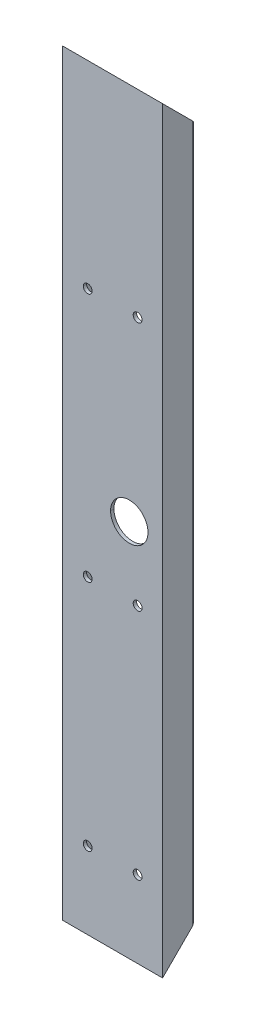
ISO-10303-21;
HEADER;
FILE_DESCRIPTION(('STEP AP214'),'2;1');
FILE_NAME('part.step','',(''),(''),'','','');
FILE_SCHEMA(('AUTOMOTIVE_DESIGN { 1 0 10303 214 1 1 1 1 }'));
ENDSEC;
DATA;
#1=APPLICATION_CONTEXT('core data for automotive mechanical design processes');
#2=APPLICATION_PROTOCOL_DEFINITION('international standard','automotive_design',2000,#1);
#3=PRODUCT_CONTEXT('',#1,'mechanical');
#4=PRODUCT('Part','Part','',(#3));
#5=PRODUCT_RELATED_PRODUCT_CATEGORY('part','',(#4));
#6=PRODUCT_DEFINITION_FORMATION('','',#4);
#7=PRODUCT_DEFINITION_CONTEXT('part definition',#1,'design');
#8=PRODUCT_DEFINITION('design','',#6,#7);
#9=PRODUCT_DEFINITION_SHAPE('','',#8);
#10=(LENGTH_UNIT() NAMED_UNIT(*) SI_UNIT(.MILLI.,.METRE.));
#11=(NAMED_UNIT(*) PLANE_ANGLE_UNIT() SI_UNIT($,.RADIAN.));
#12=(NAMED_UNIT(*) SI_UNIT($,.STERADIAN.) SOLID_ANGLE_UNIT());
#13=UNCERTAINTY_MEASURE_WITH_UNIT(LENGTH_MEASURE(1.E-05),#10,'distance_accuracy_value','');
#14=(GEOMETRIC_REPRESENTATION_CONTEXT(3) GLOBAL_UNCERTAINTY_ASSIGNED_CONTEXT((#13)) GLOBAL_UNIT_ASSIGNED_CONTEXT((#10,
#11,#12)) REPRESENTATION_CONTEXT('',''));
#15=CARTESIAN_POINT('',(0.,0.,0.));
#16=DIRECTION('',(0.,0.,1.));
#17=DIRECTION('',(1.,0.,0.));
#18=AXIS2_PLACEMENT_3D('',#15,#16,#17);
#19=CARTESIAN_POINT('',(-63.98972165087,577.85,13.9572396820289));
#20=DIRECTION('',(0.987440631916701,0.,-0.1579905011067));
#21=DIRECTION('',(-0.1579905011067,0.,-0.987440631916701));
#22=AXIS2_PLACEMENT_3D('',#19,#20,#21);
#23=PLANE('',#22);
#24=DIRECTION('',(0.112419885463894,0.702624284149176,0.702624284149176));
#25=VECTOR('',#24,1.);
#26=CARTESIAN_POINT('',(-69.5959999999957,532.384,-21.0819999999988));
#27=LINE('',#26,#25);
#28=CARTESIAN_POINT('',(-69.5959999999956,532.384,-21.0819999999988));
#29=VERTEX_POINT('',#28);
#30=CARTESIAN_POINT('',(-63.98972165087,567.423239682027,13.9572396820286));
#31=VERTEX_POINT('',#30);
#32=EDGE_CURVE('E396',#29,#31,#27,.T.);
#33=ORIENTED_EDGE('',*,*,#32,.T.);
#34=DIRECTION('',(0.,-1.,0.));
#35=VECTOR('',#34,1.);
#36=CARTESIAN_POINT('',(-63.9897216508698,577.85,13.9572396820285));
#37=LINE('',#36,#35);
#38=CARTESIAN_POINT('',(-63.989721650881,-567.423239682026,13.9572396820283));
#39=VERTEX_POINT('',#38);
#40=EDGE_CURVE('E258',#39,#31,#37,.F.);
#41=ORIENTED_EDGE('',*,*,#40,.F.);
#42=DIRECTION('',(-0.11241988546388,0.702624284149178,-0.702624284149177));
#43=VECTOR('',#42,1.);
#44=CARTESIAN_POINT('',(-63.9897216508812,-567.423239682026,13.9572396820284));
#45=LINE('',#44,#43);
#46=CARTESIAN_POINT('',(-69.5960000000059,-532.383999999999,-21.0819999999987));
#47=VERTEX_POINT('',#46);
#48=EDGE_CURVE('E266',#39,#47,#45,.T.);
#49=ORIENTED_EDGE('',*,*,#48,.T.);
#50=DIRECTION('',(0.,-1.,0.));
#51=VECTOR('',#50,1.);
#52=CARTESIAN_POINT('',(-69.5959999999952,577.85,-21.0819999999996));
#53=LINE('',#52,#51);
#54=EDGE_CURVE('E263',#29,#47,#53,.T.);
#55=ORIENTED_EDGE('',*,*,#54,.F.);
#56=EDGE_LOOP('',(#33,#41,#49,#55));
#57=FACE_BOUND('',#56,.T.);
#58=CARTESIAN_POINT('',(-66.3854399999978,273.050000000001,-1.01599999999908));
#59=DIRECTION('',(0.987440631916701,0.,-0.1579905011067));
#60=DIRECTION('',(-0.1579905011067,0.,-0.987440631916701));
#61=AXIS2_PLACEMENT_3D('',#58,#59,#60);
#62=ELLIPSE('',#61,6.8326892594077,6.746875);
#63=CARTESIAN_POINT('',(-66.3854399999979,266.303125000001,-1.01599999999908));
#64=VERTEX_POINT('',#63);
#65=CARTESIAN_POINT('',(-66.3854399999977,279.796875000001,-1.01599999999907));
#66=VERTEX_POINT('',#65);
#67=EDGE_CURVE('E417',#64,#66,#62,.F.);
#68=ORIENTED_EDGE('',*,*,#67,.T.);
#69=CARTESIAN_POINT('',(-66.3854399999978,273.050000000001,-1.01599999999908));
#70=DIRECTION('',(0.987440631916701,0.,-0.1579905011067));
#71=DIRECTION('',(-0.1579905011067,0.,-0.987440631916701));
#72=AXIS2_PLACEMENT_3D('',#69,#70,#71);
#73=ELLIPSE('',#72,6.8326892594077,6.746875);
#74=CARTESIAN_POINT('',(-67.464939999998,273.050000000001,-7.76287499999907));
#75=VERTEX_POINT('',#74);
#76=EDGE_CURVE('E414',#66,#75,#73,.F.);
#77=ORIENTED_EDGE('',*,*,#76,.T.);
#78=CARTESIAN_POINT('',(-66.3854399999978,273.050000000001,-1.01599999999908));
#79=DIRECTION('',(0.987440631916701,0.,-0.1579905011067));
#80=DIRECTION('',(-0.1579905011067,0.,-0.987440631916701));
#81=AXIS2_PLACEMENT_3D('',#78,#79,#80);
#82=ELLIPSE('',#81,6.8326892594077,6.746875);
#83=EDGE_CURVE('E411',#75,#64,#82,.F.);
#84=ORIENTED_EDGE('',*,*,#83,.T.);
#85=EDGE_LOOP('',(#68,#77,#84));
#86=FACE_BOUND('',#85,.T.);
#87=CARTESIAN_POINT('',(-66.3854399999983,222.250000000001,-1.01599999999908));
#88=DIRECTION('',(0.987440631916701,0.,-0.1579905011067));
#89=DIRECTION('',(-0.1579905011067,0.,-0.987440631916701));
#90=AXIS2_PLACEMENT_3D('',#87,#88,#89);
#91=ELLIPSE('',#90,6.8326892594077,6.746875);
#92=CARTESIAN_POINT('',(-66.3854399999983,215.503125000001,-1.01599999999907));
#93=VERTEX_POINT('',#92);
#94=CARTESIAN_POINT('',(-66.3854399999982,228.996875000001,-1.01599999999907));
#95=VERTEX_POINT('',#94);
#96=EDGE_CURVE('E425',#93,#95,#91,.F.);
#97=ORIENTED_EDGE('',*,*,#96,.T.);
#98=CARTESIAN_POINT('',(-66.3854399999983,222.250000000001,-1.01599999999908));
#99=DIRECTION('',(0.987440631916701,0.,-0.1579905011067));
#100=DIRECTION('',(-0.1579905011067,0.,-0.987440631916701));
#101=AXIS2_PLACEMENT_3D('',#98,#99,#100);
#102=ELLIPSE('',#101,6.8326892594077,6.746875);
#103=CARTESIAN_POINT('',(-67.4649399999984,222.250000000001,-7.76287499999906));
#104=VERTEX_POINT('',#103);
#105=EDGE_CURVE('E422',#95,#104,#102,.F.);
#106=ORIENTED_EDGE('',*,*,#105,.T.);
#107=CARTESIAN_POINT('',(-66.3854399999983,222.250000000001,-1.01599999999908));
#108=DIRECTION('',(0.987440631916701,0.,-0.1579905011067));
#109=DIRECTION('',(-0.1579905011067,0.,-0.987440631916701));
#110=AXIS2_PLACEMENT_3D('',#107,#108,#109);
#111=ELLIPSE('',#110,6.8326892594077,6.746875);
#112=EDGE_CURVE('E420',#104,#93,#111,.F.);
#113=ORIENTED_EDGE('',*,*,#112,.T.);
#114=EDGE_LOOP('',(#97,#106,#113));
#115=FACE_BOUND('',#114,.T.);
#116=CARTESIAN_POINT('',(-66.3854400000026,-222.249999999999,-1.01599999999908));
#117=DIRECTION('',(0.987440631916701,0.,-0.1579905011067));
#118=DIRECTION('',(0.1579905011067,0.,0.987440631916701));
#119=AXIS2_PLACEMENT_3D('',#116,#117,#118);
#120=ELLIPSE('',#119,6.8326892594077,6.746875);
#121=CARTESIAN_POINT('',(-66.3854400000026,-228.996875,-1.01599999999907));
#122=VERTEX_POINT('',#121);
#123=CARTESIAN_POINT('',(-66.3854400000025,-215.503125,-1.01599999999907));
#124=VERTEX_POINT('',#123);
#125=EDGE_CURVE('E428',#122,#124,#120,.F.);
#126=ORIENTED_EDGE('',*,*,#125,.T.);
#127=CARTESIAN_POINT('',(-66.3854400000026,-222.249999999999,-1.01599999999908));
#128=DIRECTION('',(0.987440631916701,0.,-0.1579905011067));
#129=DIRECTION('',(0.1579905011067,0.,0.987440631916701));
#130=AXIS2_PLACEMENT_3D('',#127,#128,#129);
#131=ELLIPSE('',#130,6.8326892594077,6.746875);
#132=CARTESIAN_POINT('',(-67.4649400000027,-222.25,-7.76287499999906));
#133=VERTEX_POINT('',#132);
#134=EDGE_CURVE('E244',#124,#133,#131,.F.);
#135=ORIENTED_EDGE('',*,*,#134,.T.);
#136=CARTESIAN_POINT('',(-66.3854400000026,-222.249999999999,-1.01599999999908));
#137=DIRECTION('',(0.987440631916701,0.,-0.1579905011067));
#138=DIRECTION('',(0.1579905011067,0.,0.987440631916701));
#139=AXIS2_PLACEMENT_3D('',#136,#137,#138);
#140=ELLIPSE('',#139,6.8326892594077,6.746875);
#141=EDGE_CURVE('E246',#133,#122,#140,.F.);
#142=ORIENTED_EDGE('',*,*,#141,.T.);
#143=EDGE_LOOP('',(#126,#135,#142));
#144=FACE_BOUND('',#143,.T.);
#145=CARTESIAN_POINT('',(-66.3854400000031,-273.049999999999,-1.01599999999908));
#146=DIRECTION('',(0.987440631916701,0.,-0.1579905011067));
#147=DIRECTION('',(0.1579905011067,0.,0.987440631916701));
#148=AXIS2_PLACEMENT_3D('',#145,#146,#147);
#149=ELLIPSE('',#148,6.8326892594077,6.746875);
#150=CARTESIAN_POINT('',(-66.3854400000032,-279.796875,-1.01599999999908));
#151=VERTEX_POINT('',#150);
#152=CARTESIAN_POINT('',(-66.385440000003,-266.303125,-1.01599999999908));
#153=VERTEX_POINT('',#152);
#154=EDGE_CURVE('E225',#151,#153,#149,.F.);
#155=ORIENTED_EDGE('',*,*,#154,.T.);
#156=CARTESIAN_POINT('',(-66.3854400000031,-273.049999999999,-1.01599999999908));
#157=DIRECTION('',(0.987440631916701,0.,-0.1579905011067));
#158=DIRECTION('',(0.1579905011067,0.,0.987440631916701));
#159=AXIS2_PLACEMENT_3D('',#156,#157,#158);
#160=ELLIPSE('',#159,6.8326892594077,6.746875);
#161=CARTESIAN_POINT('',(-67.4649400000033,-273.05,-7.76287499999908));
#162=VERTEX_POINT('',#161);
#163=EDGE_CURVE('E19',#153,#162,#160,.F.);
#164=ORIENTED_EDGE('',*,*,#163,.T.);
#165=CARTESIAN_POINT('',(-66.3854400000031,-273.049999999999,-1.01599999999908));
#166=DIRECTION('',(0.987440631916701,0.,-0.1579905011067));
#167=DIRECTION('',(0.1579905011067,0.,0.987440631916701));
#168=AXIS2_PLACEMENT_3D('',#165,#166,#167);
#169=ELLIPSE('',#168,6.8326892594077,6.746875);
#170=EDGE_CURVE('E228',#162,#151,#169,.F.);
#171=ORIENTED_EDGE('',*,*,#170,.T.);
#172=EDGE_LOOP('',(#155,#164,#171));
#173=FACE_BOUND('',#172,.T.);
#174=ADVANCED_FACE('F16',(#57,#86,#115,#144,#173),#23,.T.);
#175=CARTESIAN_POINT('',(-57.719473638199,579.64324,12.9540000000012));
#176=DIRECTION('',(0.,-1.,0.));
#177=DIRECTION('',(1.,0.,0.));
#178=AXIS2_PLACEMENT_3D('',#175,#176,#177);
#179=CYLINDRICAL_SURFACE('',#178,6.34999999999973);
#180=CARTESIAN_POINT('',(-57.7194736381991,566.42,12.9540000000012));
#181=DIRECTION('',(0.,-0.707106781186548,0.707106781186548));
#182=DIRECTION('',(0.,-0.707106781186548,-0.707106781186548));
#183=AXIS2_PLACEMENT_3D('',#180,#181,#182);
#184=ELLIPSE('',#183,8.98025612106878,6.34999999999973);
#185=CARTESIAN_POINT('',(-57.7194736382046,572.769999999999,19.3040000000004));
#186=VERTEX_POINT('',#185);
#187=EDGE_CURVE('E394',#31,#186,#184,.F.);
#188=ORIENTED_EDGE('',*,*,#187,.T.);
#189=DIRECTION('',(0.,1.,0.));
#190=VECTOR('',#189,1.);
#191=CARTESIAN_POINT('',(-57.7194736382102,142.875000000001,19.3039999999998));
#192=LINE('',#191,#190);
#193=CARTESIAN_POINT('',(-57.7194736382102,-572.769999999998,19.3040000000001));
#194=VERTEX_POINT('',#193);
#195=EDGE_CURVE('E259',#194,#186,#192,.T.);
#196=ORIENTED_EDGE('',*,*,#195,.F.);
#197=CARTESIAN_POINT('',(-57.7194736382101,-566.419999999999,12.9540000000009));
#198=DIRECTION('',(0.,0.707106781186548,0.707106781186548));
#199=DIRECTION('',(0.,-0.707106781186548,0.707106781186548));
#200=AXIS2_PLACEMENT_3D('',#197,#198,#199);
#201=ELLIPSE('',#200,8.98025612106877,6.34999999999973);
#202=EDGE_CURVE('E282',#194,#39,#201,.F.);
#203=ORIENTED_EDGE('',*,*,#202,.T.);
#204=ORIENTED_EDGE('',*,*,#40,.T.);
#205=EDGE_LOOP('',(#188,#196,#203,#204));
#206=FACE_BOUND('',#205,.T.);
#207=ADVANCED_FACE('F590',(#206),#179,.F.);
#208=CARTESIAN_POINT('',(57.7194736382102,579.643239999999,12.9540000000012));
#209=DIRECTION('',(0.,-1.,0.));
#210=DIRECTION('',(1.,0.,0.));
#211=AXIS2_PLACEMENT_3D('',#208,#209,#210);
#212=CYLINDRICAL_SURFACE('',#211,6.34999999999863);
#213=CARTESIAN_POINT('',(57.7194736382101,566.42,12.9540000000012));
#214=DIRECTION('',(0.,-0.707106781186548,0.707106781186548));
#215=DIRECTION('',(0.,-0.707106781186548,-0.707106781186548));
#216=AXIS2_PLACEMENT_3D('',#213,#214,#215);
#217=ELLIPSE('',#216,8.98025612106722,6.34999999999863);
#218=CARTESIAN_POINT('',(57.7194736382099,572.769999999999,19.3040000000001));
#219=VERTEX_POINT('',#218);
#220=CARTESIAN_POINT('',(63.98972165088,567.423239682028,13.9572396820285));
#221=VERTEX_POINT('',#220);
#222=EDGE_CURVE('E391',#219,#221,#217,.F.);
#223=ORIENTED_EDGE('',*,*,#222,.T.);
#224=DIRECTION('',(0.,1.,0.));
#225=VECTOR('',#224,1.);
#226=CARTESIAN_POINT('',(63.9897216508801,577.849999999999,13.9572396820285));
#227=LINE('',#226,#225);
#228=CARTESIAN_POINT('',(63.9897216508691,-567.423239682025,13.9572396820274));
#229=VERTEX_POINT('',#228);
#230=EDGE_CURVE('E255',#229,#221,#227,.T.);
#231=ORIENTED_EDGE('',*,*,#230,.F.);
#232=CARTESIAN_POINT('',(57.7194736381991,-566.419999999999,12.9540000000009));
#233=DIRECTION('',(0.,0.707106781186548,0.707106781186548));
#234=DIRECTION('',(0.,-0.707106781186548,0.707106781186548));
#235=AXIS2_PLACEMENT_3D('',#232,#233,#234);
#236=ELLIPSE('',#235,8.98025612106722,6.34999999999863);
#237=CARTESIAN_POINT('',(57.7194736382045,-572.769999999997,19.3039999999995));
#238=VERTEX_POINT('',#237);
#239=EDGE_CURVE('E403',#229,#238,#236,.F.);
#240=ORIENTED_EDGE('',*,*,#239,.T.);
#241=DIRECTION('',(0.,1.,0.));
#242=VECTOR('',#241,1.);
#243=CARTESIAN_POINT('',(57.7194736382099,142.875000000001,19.3039999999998));
#244=LINE('',#243,#242);
#245=EDGE_CURVE('E262',#219,#238,#244,.F.);
#246=ORIENTED_EDGE('',*,*,#245,.F.);
#247=EDGE_LOOP('',(#223,#231,#240,#246));
#248=FACE_BOUND('',#247,.T.);
#249=ADVANCED_FACE('F595',(#248),#212,.F.);
#250=CARTESIAN_POINT('',(69.5960000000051,577.849999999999,-21.0820000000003));
#251=DIRECTION('',(-0.987440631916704,0.,-0.157990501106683));
#252=DIRECTION('',(-0.157990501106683,0.,0.987440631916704));
#253=AXIS2_PLACEMENT_3D('',#250,#251,#252);
#254=PLANE('',#253);
#255=DIRECTION('',(0.112419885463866,-0.702624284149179,-0.702624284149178));
#256=VECTOR('',#255,1.);
#257=CARTESIAN_POINT('',(63.9897216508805,567.423239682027,13.9572396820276));
#258=LINE('',#257,#256);
#259=CARTESIAN_POINT('',(69.5960000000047,532.383999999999,-21.0819999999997));
#260=VERTEX_POINT('',#259);
#261=EDGE_CURVE('E390',#221,#260,#258,.T.);
#262=ORIENTED_EDGE('',*,*,#261,.T.);
#263=DIRECTION('',(0.,-1.,0.));
#264=VECTOR('',#263,1.);
#265=CARTESIAN_POINT('',(69.5960000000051,577.849999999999,-21.082));
#266=LINE('',#265,#264);
#267=CARTESIAN_POINT('',(69.5959999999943,-532.383999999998,-21.0820000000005));
#268=VERTEX_POINT('',#267);
#269=EDGE_CURVE('E239',#268,#260,#266,.F.);
#270=ORIENTED_EDGE('',*,*,#269,.F.);
#271=DIRECTION('',(-0.112419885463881,-0.702624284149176,0.702624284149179));
#272=VECTOR('',#271,1.);
#273=CARTESIAN_POINT('',(69.5959999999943,-532.383999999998,-21.0820000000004));
#274=LINE('',#273,#272);
#275=EDGE_CURVE('E405',#268,#229,#274,.T.);
#276=ORIENTED_EDGE('',*,*,#275,.T.);
#277=ORIENTED_EDGE('',*,*,#230,.T.);
#278=EDGE_LOOP('',(#262,#270,#276,#277));
#279=FACE_BOUND('',#278,.T.);
#280=ADVANCED_FACE('F637',(#279),#254,.T.);
#281=CARTESIAN_POINT('',(72.898000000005,577.849999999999,-21.082000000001));
#282=DIRECTION('',(0.,-1.,0.));
#283=DIRECTION('',(1.,0.,0.));
#284=AXIS2_PLACEMENT_3D('',#281,#282,#283);
#285=CYLINDRICAL_SURFACE('',#284,3.30199999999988);
#286=CARTESIAN_POINT('',(72.8980000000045,532.383999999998,-21.0820000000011));
#287=DIRECTION('',(0.,-0.707106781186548,0.707106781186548));
#288=DIRECTION('',(0.,-0.707106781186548,-0.707106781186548));
#289=AXIS2_PLACEMENT_3D('',#286,#287,#288);
#290=ELLIPSE('',#289,4.6697331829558,3.30199999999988);
#291=CARTESIAN_POINT('',(76.2000000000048,532.383999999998,-21.0820000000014));
#292=VERTEX_POINT('',#291);
#293=EDGE_CURVE('E387',#260,#292,#290,.T.);
#294=ORIENTED_EDGE('',*,*,#293,.T.);
#295=DIRECTION('',(0.,1.,0.));
#296=VECTOR('',#295,1.);
#297=CARTESIAN_POINT('',(76.2000000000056,577.849999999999,-21.0820000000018));
#298=LINE('',#297,#296);
#299=CARTESIAN_POINT('',(76.1999999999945,-532.383999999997,-21.0820000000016));
#300=VERTEX_POINT('',#299);
#301=EDGE_CURVE('E269',#300,#292,#298,.T.);
#302=ORIENTED_EDGE('',*,*,#301,.F.);
#303=CARTESIAN_POINT('',(72.8979999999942,-532.383999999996,-21.0820000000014));
#304=DIRECTION('',(0.,0.707106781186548,0.707106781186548));
#305=DIRECTION('',(0.,-0.707106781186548,0.707106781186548));
#306=AXIS2_PLACEMENT_3D('',#303,#304,#305);
#307=ELLIPSE('',#306,4.66973318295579,3.30199999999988);
#308=EDGE_CURVE('E406',#300,#268,#307,.T.);
#309=ORIENTED_EDGE('',*,*,#308,.T.);
#310=ORIENTED_EDGE('',*,*,#269,.T.);
#311=EDGE_LOOP('',(#294,#302,#309,#310));
#312=FACE_BOUND('',#311,.T.);
#313=ADVANCED_FACE('F634',(#312),#285,.T.);
#314=CARTESIAN_POINT('',(-63.4999999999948,-273.049999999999,-1.01599999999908));
#315=DIRECTION('',(1.,0.,0.));
#316=DIRECTION('',(0.,0.,-1.));
#317=AXIS2_PLACEMENT_3D('',#314,#315,#316);
#318=CYLINDRICAL_SURFACE('',#317,6.746875);
#319=CARTESIAN_POINT('',(-76.1999999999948,-273.049999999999,-1.01599999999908));
#320=DIRECTION('',(1.,0.,0.));
#321=DIRECTION('',(0.,0.,-1.));
#322=AXIS2_PLACEMENT_3D('',#319,#320,#321);
#323=CIRCLE('',#322,6.746875);
#324=CARTESIAN_POINT('',(-76.1999999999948,-279.796874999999,-1.01599999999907));
#325=VERTEX_POINT('',#324);
#326=CARTESIAN_POINT('',(-76.1999999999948,-266.303124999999,-1.01599999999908));
#327=VERTEX_POINT('',#326);
#328=EDGE_CURVE('E385',#325,#327,#323,.T.);
#329=ORIENTED_EDGE('',*,*,#328,.F.);
#330=DIRECTION('',(1.,0.,0.));
#331=VECTOR('',#330,1.);
#332=CARTESIAN_POINT('',(-63.4999999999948,-279.796874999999,-1.01599999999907));
#333=LINE('',#332,#331);
#334=EDGE_CURVE('E234',#325,#151,#333,.T.);
#335=ORIENTED_EDGE('',*,*,#334,.T.);
#336=ORIENTED_EDGE('',*,*,#170,.F.);
#337=ORIENTED_EDGE('',*,*,#163,.F.);
#338=DIRECTION('',(1.,0.,0.));
#339=VECTOR('',#338,1.);
#340=CARTESIAN_POINT('',(-63.4999999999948,-266.303124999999,-1.01599999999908));
#341=LINE('',#340,#339);
#342=EDGE_CURVE('E233',#153,#327,#341,.F.);
#343=ORIENTED_EDGE('',*,*,#342,.T.);
#344=EDGE_LOOP('',(#329,#335,#336,#337,#343));
#345=FACE_BOUND('',#344,.T.);
#346=ADVANCED_FACE('F237',(#345),#318,.F.);
#347=CARTESIAN_POINT('',(-63.4999999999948,-273.049999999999,-1.01599999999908));
#348=DIRECTION('',(1.,0.,0.));
#349=DIRECTION('',(0.,0.,-1.));
#350=AXIS2_PLACEMENT_3D('',#347,#348,#349);
#351=CYLINDRICAL_SURFACE('',#350,6.746875);
#352=ORIENTED_EDGE('',*,*,#154,.F.);
#353=ORIENTED_EDGE('',*,*,#334,.F.);
#354=CARTESIAN_POINT('',(-76.1999999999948,-273.049999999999,-1.01599999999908));
#355=DIRECTION('',(1.,0.,0.));
#356=DIRECTION('',(0.,0.,-1.));
#357=AXIS2_PLACEMENT_3D('',#354,#355,#356);
#358=CIRCLE('',#357,6.746875);
#359=EDGE_CURVE('E242',#327,#325,#358,.T.);
#360=ORIENTED_EDGE('',*,*,#359,.F.);
#361=ORIENTED_EDGE('',*,*,#342,.F.);
#362=EDGE_LOOP('',(#352,#353,#360,#361));
#363=FACE_BOUND('',#362,.T.);
#364=ADVANCED_FACE('F240',(#363),#351,.F.);
#365=CARTESIAN_POINT('',(-63.4999999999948,-222.249999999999,-1.01599999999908));
#366=DIRECTION('',(1.,0.,0.));
#367=DIRECTION('',(0.,0.,-1.));
#368=AXIS2_PLACEMENT_3D('',#365,#366,#367);
#369=CYLINDRICAL_SURFACE('',#368,6.746875);
#370=CARTESIAN_POINT('',(-76.1999999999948,-222.249999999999,-1.01599999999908));
#371=DIRECTION('',(1.,0.,0.));
#372=DIRECTION('',(0.,0.,-1.));
#373=AXIS2_PLACEMENT_3D('',#370,#371,#372);
#374=CIRCLE('',#373,6.746875);
#375=CARTESIAN_POINT('',(-76.1999999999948,-228.996874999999,-1.01599999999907));
#376=VERTEX_POINT('',#375);
#377=CARTESIAN_POINT('',(-76.1999999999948,-215.503124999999,-1.01599999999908));
#378=VERTEX_POINT('',#377);
#379=EDGE_CURVE('E381',#376,#378,#374,.T.);
#380=ORIENTED_EDGE('',*,*,#379,.F.);
#381=DIRECTION('',(1.,0.,0.));
#382=VECTOR('',#381,1.);
#383=CARTESIAN_POINT('',(-63.4999999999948,-228.996874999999,-1.01599999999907));
#384=LINE('',#383,#382);
#385=EDGE_CURVE('E250',#376,#122,#384,.T.);
#386=ORIENTED_EDGE('',*,*,#385,.T.);
#387=ORIENTED_EDGE('',*,*,#141,.F.);
#388=ORIENTED_EDGE('',*,*,#134,.F.);
#389=DIRECTION('',(1.,0.,0.));
#390=VECTOR('',#389,1.);
#391=CARTESIAN_POINT('',(-63.4999999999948,-215.503124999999,-1.01599999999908));
#392=LINE('',#391,#390);
#393=EDGE_CURVE('E427',#124,#378,#392,.F.);
#394=ORIENTED_EDGE('',*,*,#393,.T.);
#395=EDGE_LOOP('',(#380,#386,#387,#388,#394));
#396=FACE_BOUND('',#395,.T.);
#397=ADVANCED_FACE('F436',(#396),#369,.F.);
#398=CARTESIAN_POINT('',(-63.4999999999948,-222.249999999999,-1.01599999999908));
#399=DIRECTION('',(1.,0.,0.));
#400=DIRECTION('',(0.,0.,-1.));
#401=AXIS2_PLACEMENT_3D('',#398,#399,#400);
#402=CYLINDRICAL_SURFACE('',#401,6.746875);
#403=ORIENTED_EDGE('',*,*,#125,.F.);
#404=ORIENTED_EDGE('',*,*,#385,.F.);
#405=CARTESIAN_POINT('',(-76.1999999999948,-222.249999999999,-1.01599999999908));
#406=DIRECTION('',(1.,0.,0.));
#407=DIRECTION('',(0.,0.,-1.));
#408=AXIS2_PLACEMENT_3D('',#405,#406,#407);
#409=CIRCLE('',#408,6.746875);
#410=EDGE_CURVE('E378',#378,#376,#409,.T.);
#411=ORIENTED_EDGE('',*,*,#410,.F.);
#412=ORIENTED_EDGE('',*,*,#393,.F.);
#413=EDGE_LOOP('',(#403,#404,#411,#412));
#414=FACE_BOUND('',#413,.T.);
#415=ADVANCED_FACE('F441',(#414),#402,.F.);
#416=CARTESIAN_POINT('',(-63.4999999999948,222.250000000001,-1.01599999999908));
#417=DIRECTION('',(-1.,0.,0.));
#418=DIRECTION('',(0.,0.,1.));
#419=AXIS2_PLACEMENT_3D('',#416,#417,#418);
#420=CYLINDRICAL_SURFACE('',#419,6.746875);
#421=CARTESIAN_POINT('',(-76.1999999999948,222.250000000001,-1.01599999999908));
#422=DIRECTION('',(-1.,0.,0.));
#423=DIRECTION('',(0.,0.,1.));
#424=AXIS2_PLACEMENT_3D('',#421,#422,#423);
#425=CIRCLE('',#424,6.746875);
#426=CARTESIAN_POINT('',(-76.1999999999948,228.996875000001,-1.01599999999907));
#427=VERTEX_POINT('',#426);
#428=CARTESIAN_POINT('',(-76.1999999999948,215.503125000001,-1.01599999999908));
#429=VERTEX_POINT('',#428);
#430=EDGE_CURVE('E375',#427,#429,#425,.F.);
#431=ORIENTED_EDGE('',*,*,#430,.F.);
#432=DIRECTION('',(-1.,0.,0.));
#433=VECTOR('',#432,1.);
#434=CARTESIAN_POINT('',(-63.4999999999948,228.996875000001,-1.01599999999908));
#435=LINE('',#434,#433);
#436=EDGE_CURVE('E424',#427,#95,#435,.F.);
#437=ORIENTED_EDGE('',*,*,#436,.T.);
#438=ORIENTED_EDGE('',*,*,#96,.F.);
#439=DIRECTION('',(-1.,0.,0.));
#440=VECTOR('',#439,1.);
#441=CARTESIAN_POINT('',(-63.4999999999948,215.503125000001,-1.01599999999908));
#442=LINE('',#441,#440);
#443=EDGE_CURVE('E419',#93,#429,#442,.T.);
#444=ORIENTED_EDGE('',*,*,#443,.T.);
#445=EDGE_LOOP('',(#431,#437,#438,#444));
#446=FACE_BOUND('',#445,.T.);
#447=ADVANCED_FACE('F582',(#446),#420,.F.);
#448=CARTESIAN_POINT('',(-63.4999999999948,222.250000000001,-1.01599999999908));
#449=DIRECTION('',(-1.,0.,0.));
#450=DIRECTION('',(0.,0.,1.));
#451=AXIS2_PLACEMENT_3D('',#448,#449,#450);
#452=CYLINDRICAL_SURFACE('',#451,6.746875);
#453=ORIENTED_EDGE('',*,*,#112,.F.);
#454=ORIENTED_EDGE('',*,*,#105,.F.);
#455=ORIENTED_EDGE('',*,*,#436,.F.);
#456=CARTESIAN_POINT('',(-76.1999999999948,222.250000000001,-1.01599999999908));
#457=DIRECTION('',(-1.,0.,0.));
#458=DIRECTION('',(0.,0.,1.));
#459=AXIS2_PLACEMENT_3D('',#456,#457,#458);
#460=CIRCLE('',#459,6.746875);
#461=EDGE_CURVE('E372',#429,#427,#460,.F.);
#462=ORIENTED_EDGE('',*,*,#461,.F.);
#463=ORIENTED_EDGE('',*,*,#443,.F.);
#464=EDGE_LOOP('',(#453,#454,#455,#462,#463));
#465=FACE_BOUND('',#464,.T.);
#466=ADVANCED_FACE('F587',(#465),#452,.F.);
#467=CARTESIAN_POINT('',(-63.4999999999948,273.050000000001,-1.01599999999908));
#468=DIRECTION('',(-1.,0.,0.));
#469=DIRECTION('',(0.,0.,1.));
#470=AXIS2_PLACEMENT_3D('',#467,#468,#469);
#471=CYLINDRICAL_SURFACE('',#470,6.746875);
#472=CARTESIAN_POINT('',(-76.1999999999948,273.050000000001,-1.01599999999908));
#473=DIRECTION('',(-1.,0.,0.));
#474=DIRECTION('',(0.,0.,1.));
#475=AXIS2_PLACEMENT_3D('',#472,#473,#474);
#476=CIRCLE('',#475,6.746875);
#477=CARTESIAN_POINT('',(-76.1999999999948,279.796875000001,-1.01599999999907));
#478=VERTEX_POINT('',#477);
#479=CARTESIAN_POINT('',(-76.1999999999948,266.303125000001,-1.01599999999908));
#480=VERTEX_POINT('',#479);
#481=EDGE_CURVE('E369',#478,#480,#476,.F.);
#482=ORIENTED_EDGE('',*,*,#481,.F.);
#483=DIRECTION('',(-1.,0.,0.));
#484=VECTOR('',#483,1.);
#485=CARTESIAN_POINT('',(-63.4999999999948,279.796875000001,-1.01599999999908));
#486=LINE('',#485,#484);
#487=EDGE_CURVE('E416',#478,#66,#486,.F.);
#488=ORIENTED_EDGE('',*,*,#487,.T.);
#489=ORIENTED_EDGE('',*,*,#67,.F.);
#490=DIRECTION('',(-1.,0.,0.));
#491=VECTOR('',#490,1.);
#492=CARTESIAN_POINT('',(-63.4999999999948,266.303125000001,-1.01599999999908));
#493=LINE('',#492,#491);
#494=EDGE_CURVE('E413',#64,#480,#493,.T.);
#495=ORIENTED_EDGE('',*,*,#494,.T.);
#496=EDGE_LOOP('',(#482,#488,#489,#495));
#497=FACE_BOUND('',#496,.T.);
#498=ADVANCED_FACE('F605',(#497),#471,.F.);
#499=CARTESIAN_POINT('',(-63.4999999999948,273.050000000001,-1.01599999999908));
#500=DIRECTION('',(-1.,0.,0.));
#501=DIRECTION('',(0.,0.,1.));
#502=AXIS2_PLACEMENT_3D('',#499,#500,#501);
#503=CYLINDRICAL_SURFACE('',#502,6.746875);
#504=ORIENTED_EDGE('',*,*,#83,.F.);
#505=ORIENTED_EDGE('',*,*,#76,.F.);
#506=ORIENTED_EDGE('',*,*,#487,.F.);
#507=CARTESIAN_POINT('',(-76.1999999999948,273.050000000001,-1.01599999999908));
#508=DIRECTION('',(-1.,0.,0.));
#509=DIRECTION('',(0.,0.,1.));
#510=AXIS2_PLACEMENT_3D('',#507,#508,#509);
#511=CIRCLE('',#510,6.746875);
#512=EDGE_CURVE('E365',#480,#478,#511,.F.);
#513=ORIENTED_EDGE('',*,*,#512,.F.);
#514=ORIENTED_EDGE('',*,*,#494,.F.);
#515=EDGE_LOOP('',(#504,#505,#506,#513,#514));
#516=FACE_BOUND('',#515,.T.);
#517=ADVANCED_FACE('F608',(#516),#503,.F.);
#518=CARTESIAN_POINT('',(-72.8979999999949,577.85,-21.0819999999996));
#519=DIRECTION('',(0.,-1.,0.));
#520=DIRECTION('',(1.,0.,0.));
#521=AXIS2_PLACEMENT_3D('',#518,#519,#520);
#522=CYLINDRICAL_SURFACE('',#521,3.3019999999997);
#523=CARTESIAN_POINT('',(-72.8979999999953,532.383999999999,-21.0819999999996));
#524=DIRECTION('',(0.,-0.707106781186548,0.707106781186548));
#525=DIRECTION('',(0.,-0.707106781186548,-0.707106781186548));
#526=AXIS2_PLACEMENT_3D('',#523,#524,#525);
#527=ELLIPSE('',#526,4.66973318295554,3.3019999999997);
#528=CARTESIAN_POINT('',(-76.1999999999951,532.383999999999,-21.0819999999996));
#529=VERTEX_POINT('',#528);
#530=EDGE_CURVE('E397',#529,#29,#527,.T.);
#531=ORIENTED_EDGE('',*,*,#530,.T.);
#532=ORIENTED_EDGE('',*,*,#54,.T.);
#533=CARTESIAN_POINT('',(-72.8980000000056,-532.383999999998,-21.0819999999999));
#534=DIRECTION('',(0.,0.707106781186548,0.707106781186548));
#535=DIRECTION('',(0.,-0.707106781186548,0.707106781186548));
#536=AXIS2_PLACEMENT_3D('',#533,#534,#535);
#537=ELLIPSE('',#536,4.66973318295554,3.3019999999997);
#538=CARTESIAN_POINT('',(-76.2000000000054,-532.383999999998,-21.0819999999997));
#539=VERTEX_POINT('',#538);
#540=EDGE_CURVE('E409',#47,#539,#537,.T.);
#541=ORIENTED_EDGE('',*,*,#540,.T.);
#542=DIRECTION('',(0.,-1.,0.));
#543=VECTOR('',#542,1.);
#544=CARTESIAN_POINT('',(-76.1999999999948,577.85,-21.0819999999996));
#545=LINE('',#544,#543);
#546=EDGE_CURVE('E364',#529,#539,#545,.T.);
#547=ORIENTED_EDGE('',*,*,#546,.F.);
#548=EDGE_LOOP('',(#531,#532,#541,#547));
#549=FACE_BOUND('',#548,.T.);
#550=ADVANCED_FACE('F611',(#549),#522,.T.);
#551=CARTESIAN_POINT('',(-5.95576921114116E-12,142.875000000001,19.3039999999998));
#552=DIRECTION('',(0.,0.,-1.));
#553=DIRECTION('',(-1.,0.,0.));
#554=AXIS2_PLACEMENT_3D('',#551,#552,#553);
#555=PLANE('',#554);
#556=CARTESIAN_POINT('',(38.1000000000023,-460.374999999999,19.3039999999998));
#557=DIRECTION('',(0.,0.,1.));
#558=DIRECTION('',(1.,0.,0.));
#559=AXIS2_PLACEMENT_3D('',#556,#557,#558);
#560=CIRCLE('',#559,6.746875);
#561=CARTESIAN_POINT('',(31.3531250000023,-460.374999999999,19.3039999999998));
#562=VERTEX_POINT('',#561);
#563=CARTESIAN_POINT('',(44.8468750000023,-460.374999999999,19.3039999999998));
#564=VERTEX_POINT('',#563);
#565=EDGE_CURVE('E326',#562,#564,#560,.T.);
#566=ORIENTED_EDGE('',*,*,#565,.T.);
#567=CARTESIAN_POINT('',(38.1000000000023,-460.374999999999,19.3039999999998));
#568=DIRECTION('',(0.,0.,1.));
#569=DIRECTION('',(1.,0.,0.));
#570=AXIS2_PLACEMENT_3D('',#567,#568,#569);
#571=CIRCLE('',#570,6.746875);
#572=EDGE_CURVE('E324',#564,#562,#571,.T.);
#573=ORIENTED_EDGE('',*,*,#572,.T.);
#574=EDGE_LOOP('',(#566,#573));
#575=FACE_BOUND('',#574,.T.);
#576=CARTESIAN_POINT('',(-38.0999999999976,-460.374999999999,19.3039999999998));
#577=DIRECTION('',(0.,0.,1.));
#578=DIRECTION('',(1.,0.,0.));
#579=AXIS2_PLACEMENT_3D('',#576,#577,#578);
#580=CIRCLE('',#579,6.746875);
#581=CARTESIAN_POINT('',(-44.8468749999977,-460.374999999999,19.3039999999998));
#582=VERTEX_POINT('',#581);
#583=CARTESIAN_POINT('',(-31.3531249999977,-460.374999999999,19.3039999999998));
#584=VERTEX_POINT('',#583);
#585=EDGE_CURVE('E332',#582,#584,#580,.T.);
#586=ORIENTED_EDGE('',*,*,#585,.T.);
#587=CARTESIAN_POINT('',(-38.0999999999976,-460.374999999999,19.3039999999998));
#588=DIRECTION('',(0.,0.,1.));
#589=DIRECTION('',(1.,0.,0.));
#590=AXIS2_PLACEMENT_3D('',#587,#588,#589);
#591=CIRCLE('',#590,6.746875);
#592=EDGE_CURVE('E329',#584,#582,#591,.T.);
#593=ORIENTED_EDGE('',*,*,#592,.T.);
#594=EDGE_LOOP('',(#586,#593));
#595=FACE_BOUND('',#594,.T.);
#596=CARTESIAN_POINT('',(38.1000000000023,-104.774999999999,19.3039999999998));
#597=DIRECTION('',(0.,0.,1.));
#598=DIRECTION('',(1.,0.,0.));
#599=AXIS2_PLACEMENT_3D('',#596,#597,#598);
#600=CIRCLE('',#599,6.746875);
#601=CARTESIAN_POINT('',(31.3531250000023,-104.774999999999,19.3039999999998));
#602=VERTEX_POINT('',#601);
#603=CARTESIAN_POINT('',(44.8468750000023,-104.774999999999,19.3039999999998));
#604=VERTEX_POINT('',#603);
#605=EDGE_CURVE('E338',#602,#604,#600,.T.);
#606=ORIENTED_EDGE('',*,*,#605,.T.);
#607=CARTESIAN_POINT('',(38.1000000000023,-104.774999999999,19.3039999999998));
#608=DIRECTION('',(0.,0.,1.));
#609=DIRECTION('',(1.,0.,0.));
#610=AXIS2_PLACEMENT_3D('',#607,#608,#609);
#611=CIRCLE('',#610,6.746875);
#612=EDGE_CURVE('E335',#604,#602,#611,.T.);
#613=ORIENTED_EDGE('',*,*,#612,.T.);
#614=EDGE_LOOP('',(#606,#613));
#615=FACE_BOUND('',#614,.T.);
#616=CARTESIAN_POINT('',(-38.0999999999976,-104.774999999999,19.3039999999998));
#617=DIRECTION('',(0.,0.,1.));
#618=DIRECTION('',(1.,0.,0.));
#619=AXIS2_PLACEMENT_3D('',#616,#617,#618);
#620=CIRCLE('',#619,6.746875);
#621=CARTESIAN_POINT('',(-44.8468749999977,-104.774999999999,19.3039999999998));
#622=VERTEX_POINT('',#621);
#623=CARTESIAN_POINT('',(-31.3531249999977,-104.774999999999,19.3039999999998));
#624=VERTEX_POINT('',#623);
#625=EDGE_CURVE('E344',#622,#624,#620,.T.);
#626=ORIENTED_EDGE('',*,*,#625,.T.);
#627=CARTESIAN_POINT('',(-38.0999999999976,-104.774999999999,19.3039999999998));
#628=DIRECTION('',(0.,0.,1.));
#629=DIRECTION('',(1.,0.,0.));
#630=AXIS2_PLACEMENT_3D('',#627,#628,#629);
#631=CIRCLE('',#630,6.746875);
#632=EDGE_CURVE('E341',#624,#622,#631,.T.);
#633=ORIENTED_EDGE('',*,*,#632,.T.);
#634=EDGE_LOOP('',(#626,#633));
#635=FACE_BOUND('',#634,.T.);
#636=CARTESIAN_POINT('',(38.1000000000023,276.225000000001,19.3039999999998));
#637=DIRECTION('',(0.,0.,1.));
#638=DIRECTION('',(1.,0.,0.));
#639=AXIS2_PLACEMENT_3D('',#636,#637,#638);
#640=CIRCLE('',#639,6.746875);
#641=CARTESIAN_POINT('',(31.3531250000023,276.225000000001,19.3039999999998));
#642=VERTEX_POINT('',#641);
#643=CARTESIAN_POINT('',(44.8468750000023,276.225000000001,19.3039999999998));
#644=VERTEX_POINT('',#643);
#645=EDGE_CURVE('E350',#642,#644,#640,.T.);
#646=ORIENTED_EDGE('',*,*,#645,.T.);
#647=CARTESIAN_POINT('',(38.1000000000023,276.225000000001,19.3039999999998));
#648=DIRECTION('',(0.,0.,1.));
#649=DIRECTION('',(1.,0.,0.));
#650=AXIS2_PLACEMENT_3D('',#647,#648,#649);
#651=CIRCLE('',#650,6.746875);
#652=EDGE_CURVE('E347',#644,#642,#651,.T.);
#653=ORIENTED_EDGE('',*,*,#652,.T.);
#654=EDGE_LOOP('',(#646,#653));
#655=FACE_BOUND('',#654,.T.);
#656=CARTESIAN_POINT('',(-38.0999999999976,276.225000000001,19.3039999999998));
#657=DIRECTION('',(0.,0.,1.));
#658=DIRECTION('',(1.,0.,0.));
#659=AXIS2_PLACEMENT_3D('',#656,#657,#658);
#660=CIRCLE('',#659,6.746875);
#661=CARTESIAN_POINT('',(-44.8468749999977,276.225000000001,19.3039999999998));
#662=VERTEX_POINT('',#661);
#663=CARTESIAN_POINT('',(-31.3531249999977,276.225000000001,19.3039999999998));
#664=VERTEX_POINT('',#663);
#665=EDGE_CURVE('E356',#662,#664,#660,.T.);
#666=ORIENTED_EDGE('',*,*,#665,.T.);
#667=CARTESIAN_POINT('',(-38.0999999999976,276.225000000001,19.3039999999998));
#668=DIRECTION('',(0.,0.,1.));
#669=DIRECTION('',(1.,0.,0.));
#670=AXIS2_PLACEMENT_3D('',#667,#668,#669);
#671=CIRCLE('',#670,6.746875);
#672=EDGE_CURVE('E353',#664,#662,#671,.T.);
#673=ORIENTED_EDGE('',*,*,#672,.T.);
#674=EDGE_LOOP('',(#666,#673));
#675=FACE_BOUND('',#674,.T.);
#676=CARTESIAN_POINT('',(25.4000000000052,9.02389274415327E-13,19.3040000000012));
#677=DIRECTION('',(0.,0.,1.));
#678=DIRECTION('',(1.,0.,0.));
#679=AXIS2_PLACEMENT_3D('',#676,#677,#678);
#680=CIRCLE('',#679,28.575);
#681=CARTESIAN_POINT('',(-3.17499999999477,9.05888587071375E-13,19.3040000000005));
#682=VERTEX_POINT('',#681);
#683=CARTESIAN_POINT('',(53.9750000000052,8.9888996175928E-13,19.3040000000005));
#684=VERTEX_POINT('',#683);
#685=EDGE_CURVE('E359',#682,#684,#680,.T.);
#686=ORIENTED_EDGE('',*,*,#685,.T.);
#687=CARTESIAN_POINT('',(25.4000000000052,9.02389274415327E-13,19.3039999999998));
#688=DIRECTION('',(0.,0.,1.));
#689=DIRECTION('',(1.,0.,0.));
#690=AXIS2_PLACEMENT_3D('',#687,#688,#689);
#691=CIRCLE('',#690,28.575);
#692=EDGE_CURVE('E362',#684,#682,#691,.T.);
#693=ORIENTED_EDGE('',*,*,#692,.T.);
#694=EDGE_LOOP('',(#686,#693));
#695=FACE_BOUND('',#694,.T.);
#696=DIRECTION('',(1.,0.,0.));
#697=VECTOR('',#696,1.);
#698=CARTESIAN_POINT('',(-1.62430069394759E-12,572.77,19.3040000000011));
#699=LINE('',#698,#697);
#700=EDGE_CURVE('E393',#186,#219,#699,.T.);
#701=ORIENTED_EDGE('',*,*,#700,.T.);
#702=ORIENTED_EDGE('',*,*,#245,.T.);
#703=DIRECTION('',(1.,0.,0.));
#704=VECTOR('',#703,1.);
#705=CARTESIAN_POINT('',(-9.02389274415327E-13,-572.769999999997,19.3039999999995));
#706=LINE('',#705,#704);
#707=EDGE_CURVE('E402',#238,#194,#706,.F.);
#708=ORIENTED_EDGE('',*,*,#707,.T.);
#709=ORIENTED_EDGE('',*,*,#195,.T.);
#710=EDGE_LOOP('',(#701,#702,#708,#709));
#711=FACE_BOUND('',#710,.T.);
#712=ADVANCED_FACE('F529',(#575,#595,#615,#635,#655,#675,#695,#711),#555,.T.);
#713=CARTESIAN_POINT('',(-9.02389274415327E-13,-276.732999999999,-276.732999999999));
#714=DIRECTION('',(0.,0.707106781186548,0.707106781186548));
#715=DIRECTION('',(0.,-0.707106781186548,0.707106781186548));
#716=AXIS2_PLACEMENT_3D('',#713,#714,#715);
#717=PLANE('',#716);
#718=ORIENTED_EDGE('',*,*,#707,.F.);
#719=ORIENTED_EDGE('',*,*,#239,.F.);
#720=ORIENTED_EDGE('',*,*,#275,.F.);
#721=ORIENTED_EDGE('',*,*,#308,.F.);
#722=DIRECTION('',(0.,0.707106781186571,-0.707106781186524));
#723=VECTOR('',#722,1.);
#724=CARTESIAN_POINT('',(76.1999999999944,-577.85,24.3839999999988));
#725=LINE('',#724,#723);
#726=CARTESIAN_POINT('',(76.1999999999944,-577.849999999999,24.3840000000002));
#727=VERTEX_POINT('',#726);
#728=EDGE_CURVE('E272',#727,#300,#725,.T.);
#729=ORIENTED_EDGE('',*,*,#728,.F.);
#730=DIRECTION('',(1.,0.,0.));
#731=VECTOR('',#730,1.);
#732=CARTESIAN_POINT('',(-5.95576921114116E-12,-577.849999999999,24.3840000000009));
#733=LINE('',#732,#731);
#734=CARTESIAN_POINT('',(-76.2000000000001,-577.849999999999,24.3840000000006));
#735=VERTEX_POINT('',#734);
#736=EDGE_CURVE('E277',#735,#727,#733,.T.);
#737=ORIENTED_EDGE('',*,*,#736,.F.);
#738=DIRECTION('',(0.,-0.707106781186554,0.707106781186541));
#739=VECTOR('',#738,1.);
#740=CARTESIAN_POINT('',(-76.2000000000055,-532.383999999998,-21.0820000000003));
#741=LINE('',#740,#739);
#742=EDGE_CURVE('E368',#539,#735,#741,.T.);
#743=ORIENTED_EDGE('',*,*,#742,.F.);
#744=ORIENTED_EDGE('',*,*,#540,.F.);
#745=ORIENTED_EDGE('',*,*,#48,.F.);
#746=ORIENTED_EDGE('',*,*,#202,.F.);
#747=EDGE_LOOP('',(#718,#719,#720,#721,#729,#737,#743,#744,#745,#746));
#748=FACE_BOUND('',#747,.T.);
#749=ADVANCED_FACE('F658',(#748),#717,.F.);
#750=CARTESIAN_POINT('',(76.2000000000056,577.849999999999,24.3839999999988));
#751=DIRECTION('',(1.,0.,0.));
#752=DIRECTION('',(0.,1.,0.));
#753=AXIS2_PLACEMENT_3D('',#750,#751,#752);
#754=PLANE('',#753);
#755=DIRECTION('',(0.,-0.707106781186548,-0.707106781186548));
#756=VECTOR('',#755,1.);
#757=CARTESIAN_POINT('',(76.2000000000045,276.732999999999,-276.733));
#758=LINE('',#757,#756);
#759=CARTESIAN_POINT('',(76.2000000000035,577.849999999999,24.384));
#760=VERTEX_POINT('',#759);
#761=EDGE_CURVE('E271',#292,#760,#758,.F.);
#762=ORIENTED_EDGE('',*,*,#761,.T.);
#763=DIRECTION('',(0.,1.,0.));
#764=VECTOR('',#763,1.);
#765=CARTESIAN_POINT('',(76.1999999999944,142.875000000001,24.3840000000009));
#766=LINE('',#765,#764);
#767=EDGE_CURVE('E273',#727,#760,#766,.T.);
#768=ORIENTED_EDGE('',*,*,#767,.F.);
#769=ORIENTED_EDGE('',*,*,#728,.T.);
#770=ORIENTED_EDGE('',*,*,#301,.T.);
#771=EDGE_LOOP('',(#762,#768,#769,#770));
#772=FACE_BOUND('',#771,.T.);
#773=ADVANCED_FACE('F458',(#772),#754,.T.);
#774=CARTESIAN_POINT('',(-1.62430069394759E-12,276.732999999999,-276.732999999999));
#775=DIRECTION('',(0.,-0.707106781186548,0.707106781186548));
#776=DIRECTION('',(0.,-0.707106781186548,-0.707106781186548));
#777=AXIS2_PLACEMENT_3D('',#774,#775,#776);
#778=PLANE('',#777);
#779=ORIENTED_EDGE('',*,*,#261,.F.);
#780=ORIENTED_EDGE('',*,*,#222,.F.);
#781=ORIENTED_EDGE('',*,*,#700,.F.);
#782=ORIENTED_EDGE('',*,*,#187,.F.);
#783=ORIENTED_EDGE('',*,*,#32,.F.);
#784=ORIENTED_EDGE('',*,*,#530,.F.);
#785=DIRECTION('',(0.,-0.707106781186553,-0.707106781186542));
#786=VECTOR('',#785,1.);
#787=CARTESIAN_POINT('',(-76.1999999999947,577.85,24.3840000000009));
#788=LINE('',#787,#786);
#789=CARTESIAN_POINT('',(-76.1999999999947,577.849999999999,24.3839999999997));
#790=VERTEX_POINT('',#789);
#791=EDGE_CURVE('E550',#790,#529,#788,.T.);
#792=ORIENTED_EDGE('',*,*,#791,.F.);
#793=DIRECTION('',(1.,0.,0.));
#794=VECTOR('',#793,1.);
#795=CARTESIAN_POINT('',(-5.95576921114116E-12,577.849999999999,24.3840000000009));
#796=LINE('',#795,#794);
#797=EDGE_CURVE('E276',#760,#790,#796,.F.);
#798=ORIENTED_EDGE('',*,*,#797,.F.);
#799=ORIENTED_EDGE('',*,*,#761,.F.);
#800=ORIENTED_EDGE('',*,*,#293,.F.);
#801=EDGE_LOOP('',(#779,#780,#781,#782,#783,#784,#792,#798,#799,#800));
#802=FACE_BOUND('',#801,.T.);
#803=ADVANCED_FACE('F447',(#802),#778,.F.);
#804=CARTESIAN_POINT('',(-76.1999999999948,577.85,-21.0819999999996));
#805=DIRECTION('',(-1.,0.,0.));
#806=DIRECTION('',(0.,-1.,0.));
#807=AXIS2_PLACEMENT_3D('',#804,#805,#806);
#808=PLANE('',#807);
#809=ORIENTED_EDGE('',*,*,#791,.T.);
#810=ORIENTED_EDGE('',*,*,#546,.T.);
#811=ORIENTED_EDGE('',*,*,#742,.T.);
#812=DIRECTION('',(0.,1.,0.));
#813=VECTOR('',#812,1.);
#814=CARTESIAN_POINT('',(-76.1999999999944,142.875000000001,24.3840000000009));
#815=LINE('',#814,#813);
#816=EDGE_CURVE('E323',#790,#735,#815,.F.);
#817=ORIENTED_EDGE('',*,*,#816,.F.);
#818=EDGE_LOOP('',(#809,#810,#811,#817));
#819=FACE_BOUND('',#818,.T.);
#820=ORIENTED_EDGE('',*,*,#481,.T.);
#821=ORIENTED_EDGE('',*,*,#512,.T.);
#822=EDGE_LOOP('',(#820,#821));
#823=FACE_BOUND('',#822,.T.);
#824=ORIENTED_EDGE('',*,*,#430,.T.);
#825=ORIENTED_EDGE('',*,*,#461,.T.);
#826=EDGE_LOOP('',(#824,#825));
#827=FACE_BOUND('',#826,.T.);
#828=ORIENTED_EDGE('',*,*,#379,.T.);
#829=ORIENTED_EDGE('',*,*,#410,.T.);
#830=EDGE_LOOP('',(#828,#829));
#831=FACE_BOUND('',#830,.T.);
#832=ORIENTED_EDGE('',*,*,#328,.T.);
#833=ORIENTED_EDGE('',*,*,#359,.T.);
#834=EDGE_LOOP('',(#832,#833));
#835=FACE_BOUND('',#834,.T.);
#836=ADVANCED_FACE('F443',(#819,#823,#827,#831,#835),#808,.T.);
#837=CARTESIAN_POINT('',(25.4000000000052,9.02389274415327E-13,16.4465000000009));
#838=DIRECTION('',(0.,0.,1.));
#839=DIRECTION('',(1.,0.,0.));
#840=AXIS2_PLACEMENT_3D('',#837,#838,#839);
#841=CYLINDRICAL_SURFACE('',#840,28.575);
#842=CARTESIAN_POINT('',(25.4000000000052,9.02389274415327E-13,24.3840000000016));
#843=DIRECTION('',(0.,0.,1.));
#844=DIRECTION('',(1.,0.,0.));
#845=AXIS2_PLACEMENT_3D('',#842,#843,#844);
#846=CIRCLE('',#845,28.575);
#847=CARTESIAN_POINT('',(-3.17499999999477,9.05888587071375E-13,24.3840000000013));
#848=VERTEX_POINT('',#847);
#849=CARTESIAN_POINT('',(53.9750000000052,8.9888996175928E-13,24.3840000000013));
#850=VERTEX_POINT('',#849);
#851=EDGE_CURVE('E320',#848,#850,#846,.F.);
#852=ORIENTED_EDGE('',*,*,#851,.F.);
#853=DIRECTION('',(0.,0.,1.));
#854=VECTOR('',#853,1.);
#855=CARTESIAN_POINT('',(-3.17499999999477,5.5057281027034E-13,16.4465000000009));
#856=LINE('',#855,#854);
#857=EDGE_CURVE('E361',#848,#682,#856,.F.);
#858=ORIENTED_EDGE('',*,*,#857,.T.);
#859=ORIENTED_EDGE('',*,*,#692,.F.);
#860=DIRECTION('',(0.,0.,1.));
#861=VECTOR('',#860,1.);
#862=CARTESIAN_POINT('',(53.9750000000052,9.02389274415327E-13,16.4465000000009));
#863=LINE('',#862,#861);
#864=EDGE_CURVE('E358',#684,#850,#863,.T.);
#865=ORIENTED_EDGE('',*,*,#864,.T.);
#866=EDGE_LOOP('',(#852,#858,#859,#865));
#867=FACE_BOUND('',#866,.T.);
#868=ADVANCED_FACE('F446',(#867),#841,.F.);
#869=CARTESIAN_POINT('',(25.4000000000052,9.02389274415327E-13,16.4465000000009));
#870=DIRECTION('',(0.,0.,1.));
#871=DIRECTION('',(1.,0.,0.));
#872=AXIS2_PLACEMENT_3D('',#869,#870,#871);
#873=CYLINDRICAL_SURFACE('',#872,28.575);
#874=ORIENTED_EDGE('',*,*,#685,.F.);
#875=ORIENTED_EDGE('',*,*,#857,.F.);
#876=CARTESIAN_POINT('',(25.4000000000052,9.02389274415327E-13,24.3840000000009));
#877=DIRECTION('',(0.,0.,1.));
#878=DIRECTION('',(1.,0.,0.));
#879=AXIS2_PLACEMENT_3D('',#876,#877,#878);
#880=CIRCLE('',#879,28.575);
#881=EDGE_CURVE('E317',#850,#848,#880,.F.);
#882=ORIENTED_EDGE('',*,*,#881,.F.);
#883=ORIENTED_EDGE('',*,*,#864,.F.);
#884=EDGE_LOOP('',(#874,#875,#882,#883));
#885=FACE_BOUND('',#884,.T.);
#886=ADVANCED_FACE('F455',(#885),#873,.F.);
#887=CARTESIAN_POINT('',(-38.0999999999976,276.225000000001,-26.4159999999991));
#888=DIRECTION('',(0.,0.,1.));
#889=DIRECTION('',(1.,0.,0.));
#890=AXIS2_PLACEMENT_3D('',#887,#888,#889);
#891=CYLINDRICAL_SURFACE('',#890,6.746875);
#892=ORIENTED_EDGE('',*,*,#665,.F.);
#893=DIRECTION('',(0.,0.,1.));
#894=VECTOR('',#893,1.);
#895=CARTESIAN_POINT('',(-44.8468749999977,276.225000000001,-26.4159999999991));
#896=LINE('',#895,#894);
#897=CARTESIAN_POINT('',(-44.8468749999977,276.225000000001,24.3840000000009));
#898=VERTEX_POINT('',#897);
#899=EDGE_CURVE('E355',#662,#898,#896,.T.);
#900=ORIENTED_EDGE('',*,*,#899,.T.);
#901=CARTESIAN_POINT('',(-38.0999999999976,276.225000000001,24.3840000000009));
#902=DIRECTION('',(0.,0.,1.));
#903=DIRECTION('',(1.,0.,0.));
#904=AXIS2_PLACEMENT_3D('',#901,#902,#903);
#905=CIRCLE('',#904,6.746875);
#906=CARTESIAN_POINT('',(-31.3531249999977,276.225000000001,24.3840000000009));
#907=VERTEX_POINT('',#906);
#908=EDGE_CURVE('E314',#907,#898,#905,.F.);
#909=ORIENTED_EDGE('',*,*,#908,.F.);
#910=DIRECTION('',(0.,0.,1.));
#911=VECTOR('',#910,1.);
#912=CARTESIAN_POINT('',(-31.3531249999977,276.225000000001,-26.4159999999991));
#913=LINE('',#912,#911);
#914=EDGE_CURVE('E352',#907,#664,#913,.F.);
#915=ORIENTED_EDGE('',*,*,#914,.T.);
#916=EDGE_LOOP('',(#892,#900,#909,#915));
#917=FACE_BOUND('',#916,.T.);
#918=ADVANCED_FACE('F513',(#917),#891,.F.);
#919=CARTESIAN_POINT('',(-38.0999999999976,276.225000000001,-26.4159999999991));
#920=DIRECTION('',(0.,0.,1.));
#921=DIRECTION('',(1.,0.,0.));
#922=AXIS2_PLACEMENT_3D('',#919,#920,#921);
#923=CYLINDRICAL_SURFACE('',#922,6.746875);
#924=CARTESIAN_POINT('',(-38.0999999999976,276.225000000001,24.3840000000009));
#925=DIRECTION('',(0.,0.,1.));
#926=DIRECTION('',(1.,0.,0.));
#927=AXIS2_PLACEMENT_3D('',#924,#925,#926);
#928=CIRCLE('',#927,6.746875);
#929=EDGE_CURVE('E311',#898,#907,#928,.F.);
#930=ORIENTED_EDGE('',*,*,#929,.F.);
#931=ORIENTED_EDGE('',*,*,#899,.F.);
#932=ORIENTED_EDGE('',*,*,#672,.F.);
#933=ORIENTED_EDGE('',*,*,#914,.F.);
#934=EDGE_LOOP('',(#930,#931,#932,#933));
#935=FACE_BOUND('',#934,.T.);
#936=ADVANCED_FACE('F509',(#935),#923,.F.);
#937=CARTESIAN_POINT('',(38.1000000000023,276.225000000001,-26.4159999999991));
#938=DIRECTION('',(0.,0.,1.));
#939=DIRECTION('',(1.,0.,0.));
#940=AXIS2_PLACEMENT_3D('',#937,#938,#939);
#941=CYLINDRICAL_SURFACE('',#940,6.746875);
#942=ORIENTED_EDGE('',*,*,#645,.F.);
#943=DIRECTION('',(0.,0.,1.));
#944=VECTOR('',#943,1.);
#945=CARTESIAN_POINT('',(31.3531250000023,276.225000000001,-26.4159999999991));
#946=LINE('',#945,#944);
#947=CARTESIAN_POINT('',(31.3531250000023,276.225000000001,24.3840000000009));
#948=VERTEX_POINT('',#947);
#949=EDGE_CURVE('E349',#642,#948,#946,.T.);
#950=ORIENTED_EDGE('',*,*,#949,.T.);
#951=CARTESIAN_POINT('',(38.1000000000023,276.225000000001,24.3840000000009));
#952=DIRECTION('',(0.,0.,1.));
#953=DIRECTION('',(1.,0.,0.));
#954=AXIS2_PLACEMENT_3D('',#951,#952,#953);
#955=CIRCLE('',#954,6.746875);
#956=CARTESIAN_POINT('',(44.8468750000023,276.225000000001,24.3840000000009));
#957=VERTEX_POINT('',#956);
#958=EDGE_CURVE('E308',#957,#948,#955,.F.);
#959=ORIENTED_EDGE('',*,*,#958,.F.);
#960=DIRECTION('',(0.,0.,1.));
#961=VECTOR('',#960,1.);
#962=CARTESIAN_POINT('',(44.8468750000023,276.225000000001,-26.4159999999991));
#963=LINE('',#962,#961);
#964=EDGE_CURVE('E346',#957,#644,#963,.F.);
#965=ORIENTED_EDGE('',*,*,#964,.T.);
#966=EDGE_LOOP('',(#942,#950,#959,#965));
#967=FACE_BOUND('',#966,.T.);
#968=ADVANCED_FACE('F505',(#967),#941,.F.);
#969=CARTESIAN_POINT('',(38.1000000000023,276.225000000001,-26.4159999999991));
#970=DIRECTION('',(0.,0.,1.));
#971=DIRECTION('',(1.,0.,0.));
#972=AXIS2_PLACEMENT_3D('',#969,#970,#971);
#973=CYLINDRICAL_SURFACE('',#972,6.746875);
#974=CARTESIAN_POINT('',(38.1000000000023,276.225000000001,24.3840000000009));
#975=DIRECTION('',(0.,0.,1.));
#976=DIRECTION('',(1.,0.,0.));
#977=AXIS2_PLACEMENT_3D('',#974,#975,#976);
#978=CIRCLE('',#977,6.746875);
#979=EDGE_CURVE('E305',#948,#957,#978,.F.);
#980=ORIENTED_EDGE('',*,*,#979,.F.);
#981=ORIENTED_EDGE('',*,*,#949,.F.);
#982=ORIENTED_EDGE('',*,*,#652,.F.);
#983=ORIENTED_EDGE('',*,*,#964,.F.);
#984=EDGE_LOOP('',(#980,#981,#982,#983));
#985=FACE_BOUND('',#984,.T.);
#986=ADVANCED_FACE('F501',(#985),#973,.F.);
#987=CARTESIAN_POINT('',(-38.0999999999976,-104.774999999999,-26.4159999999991));
#988=DIRECTION('',(0.,0.,1.));
#989=DIRECTION('',(1.,0.,0.));
#990=AXIS2_PLACEMENT_3D('',#987,#988,#989);
#991=CYLINDRICAL_SURFACE('',#990,6.746875);
#992=ORIENTED_EDGE('',*,*,#625,.F.);
#993=DIRECTION('',(0.,0.,1.));
#994=VECTOR('',#993,1.);
#995=CARTESIAN_POINT('',(-44.8468749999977,-104.774999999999,-26.4159999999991));
#996=LINE('',#995,#994);
#997=CARTESIAN_POINT('',(-44.8468749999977,-104.774999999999,24.3840000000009));
#998=VERTEX_POINT('',#997);
#999=EDGE_CURVE('E343',#622,#998,#996,.T.);
#1000=ORIENTED_EDGE('',*,*,#999,.T.);
#1001=CARTESIAN_POINT('',(-38.0999999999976,-104.774999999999,24.3840000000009));
#1002=DIRECTION('',(0.,0.,1.));
#1003=DIRECTION('',(1.,0.,0.));
#1004=AXIS2_PLACEMENT_3D('',#1001,#1002,#1003);
#1005=CIRCLE('',#1004,6.746875);
#1006=CARTESIAN_POINT('',(-31.3531249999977,-104.774999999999,24.3840000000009));
#1007=VERTEX_POINT('',#1006);
#1008=EDGE_CURVE('E302',#1007,#998,#1005,.F.);
#1009=ORIENTED_EDGE('',*,*,#1008,.F.);
#1010=DIRECTION('',(0.,0.,1.));
#1011=VECTOR('',#1010,1.);
#1012=CARTESIAN_POINT('',(-31.3531249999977,-104.774999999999,-26.4159999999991));
#1013=LINE('',#1012,#1011);
#1014=EDGE_CURVE('E340',#1007,#624,#1013,.F.);
#1015=ORIENTED_EDGE('',*,*,#1014,.T.);
#1016=EDGE_LOOP('',(#992,#1000,#1009,#1015));
#1017=FACE_BOUND('',#1016,.T.);
#1018=ADVANCED_FACE('F497',(#1017),#991,.F.);
#1019=CARTESIAN_POINT('',(-38.0999999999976,-104.774999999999,-26.4159999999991));
#1020=DIRECTION('',(0.,0.,1.));
#1021=DIRECTION('',(1.,0.,0.));
#1022=AXIS2_PLACEMENT_3D('',#1019,#1020,#1021);
#1023=CYLINDRICAL_SURFACE('',#1022,6.746875);
#1024=CARTESIAN_POINT('',(-38.0999999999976,-104.774999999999,24.3840000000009));
#1025=DIRECTION('',(0.,0.,1.));
#1026=DIRECTION('',(1.,0.,0.));
#1027=AXIS2_PLACEMENT_3D('',#1024,#1025,#1026);
#1028=CIRCLE('',#1027,6.746875);
#1029=EDGE_CURVE('E299',#998,#1007,#1028,.F.);
#1030=ORIENTED_EDGE('',*,*,#1029,.F.);
#1031=ORIENTED_EDGE('',*,*,#999,.F.);
#1032=ORIENTED_EDGE('',*,*,#632,.F.);
#1033=ORIENTED_EDGE('',*,*,#1014,.F.);
#1034=EDGE_LOOP('',(#1030,#1031,#1032,#1033));
#1035=FACE_BOUND('',#1034,.T.);
#1036=ADVANCED_FACE('F493',(#1035),#1023,.F.);
#1037=CARTESIAN_POINT('',(38.1000000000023,-104.774999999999,-26.4159999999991));
#1038=DIRECTION('',(0.,0.,1.));
#1039=DIRECTION('',(1.,0.,0.));
#1040=AXIS2_PLACEMENT_3D('',#1037,#1038,#1039);
#1041=CYLINDRICAL_SURFACE('',#1040,6.746875);
#1042=ORIENTED_EDGE('',*,*,#605,.F.);
#1043=DIRECTION('',(0.,0.,1.));
#1044=VECTOR('',#1043,1.);
#1045=CARTESIAN_POINT('',(31.3531250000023,-104.774999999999,-26.4159999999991));
#1046=LINE('',#1045,#1044);
#1047=CARTESIAN_POINT('',(31.3531250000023,-104.774999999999,24.3840000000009));
#1048=VERTEX_POINT('',#1047);
#1049=EDGE_CURVE('E337',#602,#1048,#1046,.T.);
#1050=ORIENTED_EDGE('',*,*,#1049,.T.);
#1051=CARTESIAN_POINT('',(38.1000000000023,-104.774999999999,24.3840000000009));
#1052=DIRECTION('',(0.,0.,1.));
#1053=DIRECTION('',(1.,0.,0.));
#1054=AXIS2_PLACEMENT_3D('',#1051,#1052,#1053);
#1055=CIRCLE('',#1054,6.746875);
#1056=CARTESIAN_POINT('',(44.8468750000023,-104.774999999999,24.3840000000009));
#1057=VERTEX_POINT('',#1056);
#1058=EDGE_CURVE('E296',#1057,#1048,#1055,.F.);
#1059=ORIENTED_EDGE('',*,*,#1058,.F.);
#1060=DIRECTION('',(0.,0.,1.));
#1061=VECTOR('',#1060,1.);
#1062=CARTESIAN_POINT('',(44.8468750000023,-104.774999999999,-26.4159999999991));
#1063=LINE('',#1062,#1061);
#1064=EDGE_CURVE('E334',#1057,#604,#1063,.F.);
#1065=ORIENTED_EDGE('',*,*,#1064,.T.);
#1066=EDGE_LOOP('',(#1042,#1050,#1059,#1065));
#1067=FACE_BOUND('',#1066,.T.);
#1068=ADVANCED_FACE('F489',(#1067),#1041,.F.);
#1069=CARTESIAN_POINT('',(38.1000000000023,-104.774999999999,-26.4159999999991));
#1070=DIRECTION('',(0.,0.,1.));
#1071=DIRECTION('',(1.,0.,0.));
#1072=AXIS2_PLACEMENT_3D('',#1069,#1070,#1071);
#1073=CYLINDRICAL_SURFACE('',#1072,6.746875);
#1074=CARTESIAN_POINT('',(38.1000000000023,-104.774999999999,24.3840000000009));
#1075=DIRECTION('',(0.,0.,1.));
#1076=DIRECTION('',(1.,0.,0.));
#1077=AXIS2_PLACEMENT_3D('',#1074,#1075,#1076);
#1078=CIRCLE('',#1077,6.746875);
#1079=EDGE_CURVE('E293',#1048,#1057,#1078,.F.);
#1080=ORIENTED_EDGE('',*,*,#1079,.F.);
#1081=ORIENTED_EDGE('',*,*,#1049,.F.);
#1082=ORIENTED_EDGE('',*,*,#612,.F.);
#1083=ORIENTED_EDGE('',*,*,#1064,.F.);
#1084=EDGE_LOOP('',(#1080,#1081,#1082,#1083));
#1085=FACE_BOUND('',#1084,.T.);
#1086=ADVANCED_FACE('F485',(#1085),#1073,.F.);
#1087=CARTESIAN_POINT('',(-38.0999999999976,-460.374999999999,-26.4159999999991));
#1088=DIRECTION('',(0.,0.,1.));
#1089=DIRECTION('',(1.,0.,0.));
#1090=AXIS2_PLACEMENT_3D('',#1087,#1088,#1089);
#1091=CYLINDRICAL_SURFACE('',#1090,6.746875);
#1092=ORIENTED_EDGE('',*,*,#585,.F.);
#1093=DIRECTION('',(0.,0.,1.));
#1094=VECTOR('',#1093,1.);
#1095=CARTESIAN_POINT('',(-44.8468749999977,-460.374999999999,-26.4159999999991));
#1096=LINE('',#1095,#1094);
#1097=CARTESIAN_POINT('',(-44.8468749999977,-460.374999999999,24.3840000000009));
#1098=VERTEX_POINT('',#1097);
#1099=EDGE_CURVE('E331',#582,#1098,#1096,.T.);
#1100=ORIENTED_EDGE('',*,*,#1099,.T.);
#1101=CARTESIAN_POINT('',(-38.0999999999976,-460.374999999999,24.3840000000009));
#1102=DIRECTION('',(0.,0.,1.));
#1103=DIRECTION('',(1.,0.,0.));
#1104=AXIS2_PLACEMENT_3D('',#1101,#1102,#1103);
#1105=CIRCLE('',#1104,6.746875);
#1106=CARTESIAN_POINT('',(-31.3531249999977,-460.374999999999,24.3840000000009));
#1107=VERTEX_POINT('',#1106);
#1108=EDGE_CURVE('E290',#1107,#1098,#1105,.F.);
#1109=ORIENTED_EDGE('',*,*,#1108,.F.);
#1110=DIRECTION('',(0.,0.,1.));
#1111=VECTOR('',#1110,1.);
#1112=CARTESIAN_POINT('',(-31.3531249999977,-460.374999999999,-26.4159999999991));
#1113=LINE('',#1112,#1111);
#1114=EDGE_CURVE('E328',#1107,#584,#1113,.F.);
#1115=ORIENTED_EDGE('',*,*,#1114,.T.);
#1116=EDGE_LOOP('',(#1092,#1100,#1109,#1115));
#1117=FACE_BOUND('',#1116,.T.);
#1118=ADVANCED_FACE('F481',(#1117),#1091,.F.);
#1119=CARTESIAN_POINT('',(-38.0999999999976,-460.374999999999,-26.4159999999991));
#1120=DIRECTION('',(0.,0.,1.));
#1121=DIRECTION('',(1.,0.,0.));
#1122=AXIS2_PLACEMENT_3D('',#1119,#1120,#1121);
#1123=CYLINDRICAL_SURFACE('',#1122,6.746875);
#1124=CARTESIAN_POINT('',(-38.0999999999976,-460.374999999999,24.3840000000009));
#1125=DIRECTION('',(0.,0.,1.));
#1126=DIRECTION('',(1.,0.,0.));
#1127=AXIS2_PLACEMENT_3D('',#1124,#1125,#1126);
#1128=CIRCLE('',#1127,6.746875);
#1129=EDGE_CURVE('E287',#1098,#1107,#1128,.F.);
#1130=ORIENTED_EDGE('',*,*,#1129,.F.);
#1131=ORIENTED_EDGE('',*,*,#1099,.F.);
#1132=ORIENTED_EDGE('',*,*,#592,.F.);
#1133=ORIENTED_EDGE('',*,*,#1114,.F.);
#1134=EDGE_LOOP('',(#1130,#1131,#1132,#1133));
#1135=FACE_BOUND('',#1134,.T.);
#1136=ADVANCED_FACE('F478',(#1135),#1123,.F.);
#1137=CARTESIAN_POINT('',(38.1000000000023,-460.374999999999,-26.4159999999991));
#1138=DIRECTION('',(0.,0.,1.));
#1139=DIRECTION('',(1.,0.,0.));
#1140=AXIS2_PLACEMENT_3D('',#1137,#1138,#1139);
#1141=CYLINDRICAL_SURFACE('',#1140,6.746875);
#1142=ORIENTED_EDGE('',*,*,#565,.F.);
#1143=DIRECTION('',(0.,0.,1.));
#1144=VECTOR('',#1143,1.);
#1145=CARTESIAN_POINT('',(31.3531250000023,-460.374999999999,-26.4159999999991));
#1146=LINE('',#1145,#1144);
#1147=CARTESIAN_POINT('',(31.3531250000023,-460.374999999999,24.3840000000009));
#1148=VERTEX_POINT('',#1147);
#1149=EDGE_CURVE('E34',#562,#1148,#1146,.T.);
#1150=ORIENTED_EDGE('',*,*,#1149,.T.);
#1151=CARTESIAN_POINT('',(38.1000000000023,-460.374999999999,24.3840000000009));
#1152=DIRECTION('',(0.,0.,1.));
#1153=DIRECTION('',(1.,0.,0.));
#1154=AXIS2_PLACEMENT_3D('',#1151,#1152,#1153);
#1155=CIRCLE('',#1154,6.746875);
#1156=CARTESIAN_POINT('',(44.8468750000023,-460.374999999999,24.3840000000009));
#1157=VERTEX_POINT('',#1156);
#1158=EDGE_CURVE('E25',#1157,#1148,#1155,.F.);
#1159=ORIENTED_EDGE('',*,*,#1158,.F.);
#1160=DIRECTION('',(0.,0.,1.));
#1161=VECTOR('',#1160,1.);
#1162=CARTESIAN_POINT('',(44.8468750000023,-460.374999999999,-26.4159999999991));
#1163=LINE('',#1162,#1161);
#1164=EDGE_CURVE('E570',#1157,#564,#1163,.F.);
#1165=ORIENTED_EDGE('',*,*,#1164,.T.);
#1166=EDGE_LOOP('',(#1142,#1150,#1159,#1165));
#1167=FACE_BOUND('',#1166,.T.);
#1168=ADVANCED_FACE('F471',(#1167),#1141,.F.);
#1169=CARTESIAN_POINT('',(38.1000000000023,-460.374999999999,-26.4159999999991));
#1170=DIRECTION('',(0.,0.,1.));
#1171=DIRECTION('',(1.,0.,0.));
#1172=AXIS2_PLACEMENT_3D('',#1169,#1170,#1171);
#1173=CYLINDRICAL_SURFACE('',#1172,6.746875);
#1174=CARTESIAN_POINT('',(38.1000000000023,-460.374999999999,24.3840000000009));
#1175=DIRECTION('',(0.,0.,1.));
#1176=DIRECTION('',(1.,0.,0.));
#1177=AXIS2_PLACEMENT_3D('',#1174,#1175,#1176);
#1178=CIRCLE('',#1177,6.746875);
#1179=EDGE_CURVE('E11',#1148,#1157,#1178,.F.);
#1180=ORIENTED_EDGE('',*,*,#1179,.F.);
#1181=ORIENTED_EDGE('',*,*,#1149,.F.);
#1182=ORIENTED_EDGE('',*,*,#572,.F.);
#1183=ORIENTED_EDGE('',*,*,#1164,.F.);
#1184=EDGE_LOOP('',(#1180,#1181,#1182,#1183));
#1185=FACE_BOUND('',#1184,.T.);
#1186=ADVANCED_FACE('F465',(#1185),#1173,.F.);
#1187=CARTESIAN_POINT('',(-5.95576921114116E-12,142.875000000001,24.3840000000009));
#1188=DIRECTION('',(0.,0.,1.));
#1189=DIRECTION('',(1.,0.,0.));
#1190=AXIS2_PLACEMENT_3D('',#1187,#1188,#1189);
#1191=PLANE('',#1190);
#1192=ORIENTED_EDGE('',*,*,#1158,.T.);
#1193=ORIENTED_EDGE('',*,*,#1179,.T.);
#1194=EDGE_LOOP('',(#1192,#1193));
#1195=FACE_BOUND('',#1194,.T.);
#1196=ORIENTED_EDGE('',*,*,#1108,.T.);
#1197=ORIENTED_EDGE('',*,*,#1129,.T.);
#1198=EDGE_LOOP('',(#1196,#1197));
#1199=FACE_BOUND('',#1198,.T.);
#1200=ORIENTED_EDGE('',*,*,#1058,.T.);
#1201=ORIENTED_EDGE('',*,*,#1079,.T.);
#1202=EDGE_LOOP('',(#1200,#1201));
#1203=FACE_BOUND('',#1202,.T.);
#1204=ORIENTED_EDGE('',*,*,#1008,.T.);
#1205=ORIENTED_EDGE('',*,*,#1029,.T.);
#1206=EDGE_LOOP('',(#1204,#1205));
#1207=FACE_BOUND('',#1206,.T.);
#1208=ORIENTED_EDGE('',*,*,#958,.T.);
#1209=ORIENTED_EDGE('',*,*,#979,.T.);
#1210=EDGE_LOOP('',(#1208,#1209));
#1211=FACE_BOUND('',#1210,.T.);
#1212=ORIENTED_EDGE('',*,*,#908,.T.);
#1213=ORIENTED_EDGE('',*,*,#929,.T.);
#1214=EDGE_LOOP('',(#1212,#1213));
#1215=FACE_BOUND('',#1214,.T.);
#1216=ORIENTED_EDGE('',*,*,#851,.T.);
#1217=ORIENTED_EDGE('',*,*,#881,.T.);
#1218=EDGE_LOOP('',(#1216,#1217));
#1219=FACE_BOUND('',#1218,.T.);
#1220=ORIENTED_EDGE('',*,*,#797,.T.);
#1221=ORIENTED_EDGE('',*,*,#816,.T.);
#1222=ORIENTED_EDGE('',*,*,#736,.T.);
#1223=ORIENTED_EDGE('',*,*,#767,.T.);
#1224=EDGE_LOOP('',(#1220,#1221,#1222,#1223));
#1225=FACE_BOUND('',#1224,.T.);
#1226=ADVANCED_FACE('F463',(#1195,#1199,#1203,#1207,#1211,#1215,#1219,#1225),#1191,.T.);
#1227=CLOSED_SHELL('',(#174,#207,#249,#280,#313,#346,#364,#397,#415,#447,#466,#498,#517,#550,
#712,#749,#773,#803,#836,#868,#886,#918,#936,#968,#986,#1018,#1036,#1068,#1086,#1118,#1136,
#1168,#1186,#1226));
#1228=MANIFOLD_SOLID_BREP('B1',#1227);
#1229=ADVANCED_BREP_SHAPE_REPRESENTATION('',(#18,#1228),#14);
#1230=SHAPE_DEFINITION_REPRESENTATION(#9,#1229);
ENDSEC;
END-ISO-10303-21;
